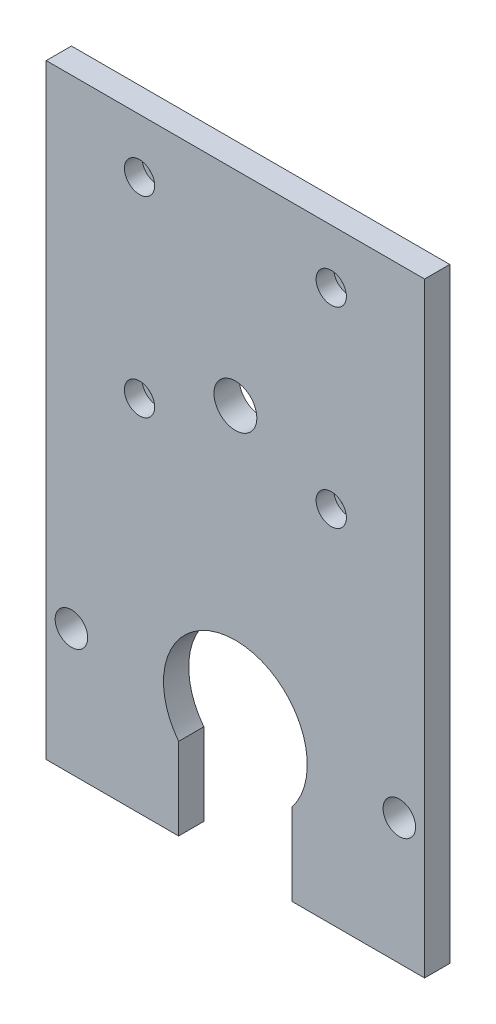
ISO-10303-21;
HEADER;
FILE_DESCRIPTION(('STEP AP214'),'2;1');
FILE_NAME('part.step','',(''),(''),'','','');
FILE_SCHEMA(('AUTOMOTIVE_DESIGN { 1 0 10303 214 1 1 1 1 }'));
ENDSEC;
DATA;
#1=APPLICATION_CONTEXT('core data for automotive mechanical design processes');
#2=APPLICATION_PROTOCOL_DEFINITION('international standard','automotive_design',2000,#1);
#3=PRODUCT_CONTEXT('',#1,'mechanical');
#4=PRODUCT('Part','Part','',(#3));
#5=PRODUCT_RELATED_PRODUCT_CATEGORY('part','',(#4));
#6=PRODUCT_DEFINITION_FORMATION('','',#4);
#7=PRODUCT_DEFINITION_CONTEXT('part definition',#1,'design');
#8=PRODUCT_DEFINITION('design','',#6,#7);
#9=PRODUCT_DEFINITION_SHAPE('','',#8);
#10=(LENGTH_UNIT() NAMED_UNIT(*) SI_UNIT(.MILLI.,.METRE.));
#11=(NAMED_UNIT(*) PLANE_ANGLE_UNIT() SI_UNIT($,.RADIAN.));
#12=(NAMED_UNIT(*) SI_UNIT($,.STERADIAN.) SOLID_ANGLE_UNIT());
#13=UNCERTAINTY_MEASURE_WITH_UNIT(LENGTH_MEASURE(1.E-05),#10,'distance_accuracy_value','');
#14=(GEOMETRIC_REPRESENTATION_CONTEXT(3) GLOBAL_UNCERTAINTY_ASSIGNED_CONTEXT((#13)) GLOBAL_UNIT_ASSIGNED_CONTEXT((#10,
#11,#12)) REPRESENTATION_CONTEXT('',''));
#15=CARTESIAN_POINT('',(0.,0.,0.));
#16=DIRECTION('',(0.,0.,1.));
#17=DIRECTION('',(1.,0.,0.));
#18=AXIS2_PLACEMENT_3D('',#15,#16,#17);
#19=CARTESIAN_POINT('',(0.,0.,5.));
#20=DIRECTION('',(0.,0.,1.));
#21=DIRECTION('',(1.,0.,0.));
#22=AXIS2_PLACEMENT_3D('',#19,#20,#21);
#23=PLANE('',#22);
#24=CARTESIAN_POINT('',(-38.,168.5,5.));
#25=DIRECTION('',(0.,0.,-1.));
#26=DIRECTION('',(-1.,0.,0.));
#27=AXIS2_PLACEMENT_3D('',#24,#25,#26);
#28=CIRCLE('',#27,6.);
#29=CARTESIAN_POINT('',(-44.,168.5,5.));
#30=VERTEX_POINT('',#29);
#31=EDGE_CURVE('E182',#30,#30,#28,.T.);
#32=ORIENTED_EDGE('',*,*,#31,.T.);
#33=EDGE_LOOP('',(#32));
#34=FACE_BOUND('',#33,.T.);
#35=CARTESIAN_POINT('',(38.,168.5,5.));
#36=DIRECTION('',(0.,0.,1.));
#37=DIRECTION('',(1.,0.,0.));
#38=AXIS2_PLACEMENT_3D('',#35,#36,#37);
#39=CIRCLE('',#38,6.);
#40=CARTESIAN_POINT('',(44.,168.5,5.));
#41=VERTEX_POINT('',#40);
#42=EDGE_CURVE('E178',#41,#41,#39,.T.);
#43=ORIENTED_EDGE('',*,*,#42,.F.);
#44=EDGE_LOOP('',(#43));
#45=FACE_BOUND('',#44,.T.);
#46=CARTESIAN_POINT('',(65.,0.,5.));
#47=DIRECTION('',(0.,0.,1.));
#48=DIRECTION('',(1.,0.,0.));
#49=AXIS2_PLACEMENT_3D('',#46,#47,#48);
#50=CIRCLE('',#49,6.45);
#51=CARTESIAN_POINT('',(71.45,0.,5.));
#52=VERTEX_POINT('',#51);
#53=EDGE_CURVE('E223',#52,#52,#50,.T.);
#54=ORIENTED_EDGE('',*,*,#53,.F.);
#55=EDGE_LOOP('',(#54));
#56=FACE_BOUND('',#55,.T.);
#57=DIRECTION('',(0.,-1.,0.));
#58=VECTOR('',#57,1.);
#59=CARTESIAN_POINT('',(-75.,-50.,5.));
#60=LINE('',#59,#58);
#61=CARTESIAN_POINT('',(-75.,190.,5.));
#62=VERTEX_POINT('',#61);
#63=CARTESIAN_POINT('',(-75.,-50.,5.));
#64=VERTEX_POINT('',#63);
#65=EDGE_CURVE('E141',#62,#64,#60,.T.);
#66=ORIENTED_EDGE('',*,*,#65,.T.);
#67=DIRECTION('',(1.,0.,0.));
#68=VECTOR('',#67,1.);
#69=CARTESIAN_POINT('',(-22.5,-50.,5.));
#70=LINE('',#69,#68);
#71=CARTESIAN_POINT('',(-22.5,-50.,5.));
#72=VERTEX_POINT('',#71);
#73=EDGE_CURVE('E118',#64,#72,#70,.T.);
#74=ORIENTED_EDGE('',*,*,#73,.T.);
#75=DIRECTION('',(0.,1.,0.));
#76=VECTOR('',#75,1.);
#77=CARTESIAN_POINT('',(-22.5,-17.4928556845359,5.));
#78=LINE('',#77,#76);
#79=CARTESIAN_POINT('',(-22.5,-17.4928556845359,5.));
#80=VERTEX_POINT('',#79);
#81=EDGE_CURVE('E144',#72,#80,#78,.T.);
#82=ORIENTED_EDGE('',*,*,#81,.T.);
#83=CARTESIAN_POINT('',(0.,0.,5.));
#84=DIRECTION('',(0.,0.,-1.));
#85=DIRECTION('',(1.,0.,0.));
#86=AXIS2_PLACEMENT_3D('',#83,#84,#85);
#87=CIRCLE('',#86,28.5);
#88=CARTESIAN_POINT('',(22.5,-17.4928556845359,5.));
#89=VERTEX_POINT('',#88);
#90=EDGE_CURVE('E146',#80,#89,#87,.T.);
#91=ORIENTED_EDGE('',*,*,#90,.T.);
#92=DIRECTION('',(0.,-1.,0.));
#93=VECTOR('',#92,1.);
#94=CARTESIAN_POINT('',(22.5,-17.4928556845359,5.));
#95=LINE('',#94,#93);
#96=CARTESIAN_POINT('',(22.5,-50.,5.));
#97=VERTEX_POINT('',#96);
#98=EDGE_CURVE('E148',#89,#97,#95,.T.);
#99=ORIENTED_EDGE('',*,*,#98,.T.);
#100=DIRECTION('',(1.,0.,0.));
#101=VECTOR('',#100,1.);
#102=CARTESIAN_POINT('',(22.5,-50.,5.));
#103=LINE('',#102,#101);
#104=CARTESIAN_POINT('',(75.,-50.,5.));
#105=VERTEX_POINT('',#104);
#106=EDGE_CURVE('E150',#97,#105,#103,.T.);
#107=ORIENTED_EDGE('',*,*,#106,.T.);
#108=DIRECTION('',(0.,1.,0.));
#109=VECTOR('',#108,1.);
#110=CARTESIAN_POINT('',(75.,-50.,5.));
#111=LINE('',#110,#109);
#112=CARTESIAN_POINT('',(75.,190.,5.));
#113=VERTEX_POINT('',#112);
#114=EDGE_CURVE('E59',#105,#113,#111,.T.);
#115=ORIENTED_EDGE('',*,*,#114,.T.);
#116=DIRECTION('',(-1.,0.,0.));
#117=VECTOR('',#116,1.);
#118=CARTESIAN_POINT('',(-75.,190.,5.));
#119=LINE('',#118,#117);
#120=EDGE_CURVE('E54',#113,#62,#119,.T.);
#121=ORIENTED_EDGE('',*,*,#120,.T.);
#122=EDGE_LOOP('',(#66,#74,#82,#91,#99,#107,#115,#121));
#123=FACE_BOUND('',#122,.T.);
#124=CARTESIAN_POINT('',(0.,109.,5.));
#125=DIRECTION('',(0.,0.,1.));
#126=DIRECTION('',(1.,0.,0.));
#127=AXIS2_PLACEMENT_3D('',#124,#125,#126);
#128=CIRCLE('',#127,8.50000000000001);
#129=CARTESIAN_POINT('',(8.50000000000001,109.,5.));
#130=VERTEX_POINT('',#129);
#131=EDGE_CURVE('E123',#130,#130,#128,.T.);
#132=ORIENTED_EDGE('',*,*,#131,.F.);
#133=EDGE_LOOP('',(#132));
#134=FACE_BOUND('',#133,.T.);
#135=CARTESIAN_POINT('',(-65.,0.,5.));
#136=DIRECTION('',(0.,0.,1.));
#137=DIRECTION('',(1.,0.,0.));
#138=AXIS2_PLACEMENT_3D('',#135,#136,#137);
#139=CIRCLE('',#138,6.45);
#140=CARTESIAN_POINT('',(-58.55,0.,5.));
#141=VERTEX_POINT('',#140);
#142=EDGE_CURVE('E217',#141,#141,#139,.T.);
#143=ORIENTED_EDGE('',*,*,#142,.F.);
#144=EDGE_LOOP('',(#143));
#145=FACE_BOUND('',#144,.T.);
#146=CARTESIAN_POINT('',(-38.,92.5000000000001,5.));
#147=DIRECTION('',(0.,0.,1.));
#148=DIRECTION('',(-1.,0.,0.));
#149=AXIS2_PLACEMENT_3D('',#146,#147,#148);
#150=CIRCLE('',#149,6.);
#151=CARTESIAN_POINT('',(-44.,92.5000000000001,5.));
#152=VERTEX_POINT('',#151);
#153=EDGE_CURVE('E189',#152,#152,#150,.T.);
#154=ORIENTED_EDGE('',*,*,#153,.F.);
#155=EDGE_LOOP('',(#154));
#156=FACE_BOUND('',#155,.T.);
#157=CARTESIAN_POINT('',(38.,92.5000000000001,5.));
#158=DIRECTION('',(0.,0.,-1.));
#159=DIRECTION('',(1.,0.,0.));
#160=AXIS2_PLACEMENT_3D('',#157,#158,#159);
#161=CIRCLE('',#160,6.);
#162=CARTESIAN_POINT('',(44.,92.5000000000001,5.));
#163=VERTEX_POINT('',#162);
#164=EDGE_CURVE('E346',#163,#163,#161,.T.);
#165=ORIENTED_EDGE('',*,*,#164,.T.);
#166=EDGE_LOOP('',(#165));
#167=FACE_BOUND('',#166,.T.);
#168=ADVANCED_FACE('F37',(#34,#45,#56,#123,#134,#145,#156,#167),#23,.T.);
#169=CARTESIAN_POINT('',(38.,92.5000000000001,-5.));
#170=DIRECTION('',(0.,0.,1.));
#171=DIRECTION('',(1.,0.,0.));
#172=AXIS2_PLACEMENT_3D('',#169,#170,#171);
#173=CYLINDRICAL_SURFACE('',#172,4.00000000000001);
#174=CARTESIAN_POINT('',(38.,92.5000000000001,-5.));
#175=DIRECTION('',(0.,0.,1.));
#176=DIRECTION('',(-1.,0.,0.));
#177=AXIS2_PLACEMENT_3D('',#174,#175,#176);
#178=CIRCLE('',#177,4.00000000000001);
#179=CARTESIAN_POINT('',(34.,92.5000000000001,-5.));
#180=VERTEX_POINT('',#179);
#181=EDGE_CURVE('E205',#180,#180,#178,.T.);
#182=ORIENTED_EDGE('',*,*,#181,.F.);
#183=EDGE_LOOP('',(#182));
#184=FACE_BOUND('',#183,.T.);
#185=CARTESIAN_POINT('',(38.,92.5000000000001,-2.));
#186=DIRECTION('',(0.,0.,1.));
#187=DIRECTION('',(1.,0.,0.));
#188=AXIS2_PLACEMENT_3D('',#185,#186,#187);
#189=CIRCLE('',#188,4.00000000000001);
#190=CARTESIAN_POINT('',(42.,92.5000000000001,-2.));
#191=VERTEX_POINT('',#190);
#192=EDGE_CURVE('E41',#191,#191,#189,.F.);
#193=ORIENTED_EDGE('',*,*,#192,.F.);
#194=EDGE_LOOP('',(#193));
#195=FACE_BOUND('',#194,.T.);
#196=ADVANCED_FACE('F247',(#184,#195),#173,.F.);
#197=CARTESIAN_POINT('',(-38.,92.5000000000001,-5.));
#198=DIRECTION('',(0.,0.,1.));
#199=DIRECTION('',(1.,0.,0.));
#200=AXIS2_PLACEMENT_3D('',#197,#198,#199);
#201=CYLINDRICAL_SURFACE('',#200,4.00000000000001);
#202=CARTESIAN_POINT('',(-38.,92.5000000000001,-5.));
#203=DIRECTION('',(0.,0.,-1.));
#204=DIRECTION('',(1.,0.,0.));
#205=AXIS2_PLACEMENT_3D('',#202,#203,#204);
#206=CIRCLE('',#205,4.00000000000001);
#207=CARTESIAN_POINT('',(-34.,92.5000000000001,-5.));
#208=VERTEX_POINT('',#207);
#209=EDGE_CURVE('E174',#208,#208,#206,.T.);
#210=ORIENTED_EDGE('',*,*,#209,.T.);
#211=EDGE_LOOP('',(#210));
#212=FACE_BOUND('',#211,.T.);
#213=CARTESIAN_POINT('',(-38.,92.5000000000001,-2.));
#214=DIRECTION('',(0.,0.,1.));
#215=DIRECTION('',(1.,0.,0.));
#216=AXIS2_PLACEMENT_3D('',#213,#214,#215);
#217=CIRCLE('',#216,4.00000000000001);
#218=CARTESIAN_POINT('',(-34.,92.5000000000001,-2.));
#219=VERTEX_POINT('',#218);
#220=EDGE_CURVE('E180',#219,#219,#217,.T.);
#221=ORIENTED_EDGE('',*,*,#220,.T.);
#222=EDGE_LOOP('',(#221));
#223=FACE_BOUND('',#222,.T.);
#224=ADVANCED_FACE('F253',(#212,#223),#201,.F.);
#225=CARTESIAN_POINT('',(-38.,168.5,-5.));
#226=DIRECTION('',(0.,0.,1.));
#227=DIRECTION('',(1.,0.,0.));
#228=AXIS2_PLACEMENT_3D('',#225,#226,#227);
#229=CYLINDRICAL_SURFACE('',#228,4.00000000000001);
#230=CARTESIAN_POINT('',(-38.,168.5,-5.));
#231=DIRECTION('',(0.,0.,1.));
#232=DIRECTION('',(1.,0.,0.));
#233=AXIS2_PLACEMENT_3D('',#230,#231,#232);
#234=CIRCLE('',#233,4.00000000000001);
#235=CARTESIAN_POINT('',(-34.,168.5,-5.));
#236=VERTEX_POINT('',#235);
#237=EDGE_CURVE('E211',#236,#236,#234,.T.);
#238=ORIENTED_EDGE('',*,*,#237,.F.);
#239=EDGE_LOOP('',(#238));
#240=FACE_BOUND('',#239,.T.);
#241=CARTESIAN_POINT('',(-38.,168.5,-2.));
#242=DIRECTION('',(0.,0.,1.));
#243=DIRECTION('',(1.,0.,0.));
#244=AXIS2_PLACEMENT_3D('',#241,#242,#243);
#245=CIRCLE('',#244,4.00000000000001);
#246=CARTESIAN_POINT('',(-34.,168.5,-2.));
#247=VERTEX_POINT('',#246);
#248=EDGE_CURVE('E176',#247,#247,#245,.F.);
#249=ORIENTED_EDGE('',*,*,#248,.F.);
#250=EDGE_LOOP('',(#249));
#251=FACE_BOUND('',#250,.T.);
#252=ADVANCED_FACE('F288',(#240,#251),#229,.F.);
#253=CARTESIAN_POINT('',(38.,168.5,-5.));
#254=DIRECTION('',(0.,0.,1.));
#255=DIRECTION('',(1.,0.,0.));
#256=AXIS2_PLACEMENT_3D('',#253,#254,#255);
#257=CYLINDRICAL_SURFACE('',#256,4.00000000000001);
#258=CARTESIAN_POINT('',(38.,168.5,-5.));
#259=DIRECTION('',(0.,0.,-1.));
#260=DIRECTION('',(-1.,0.,0.));
#261=AXIS2_PLACEMENT_3D('',#258,#259,#260);
#262=CIRCLE('',#261,4.00000000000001);
#263=CARTESIAN_POINT('',(34.,168.5,-5.));
#264=VERTEX_POINT('',#263);
#265=EDGE_CURVE('E208',#264,#264,#262,.T.);
#266=ORIENTED_EDGE('',*,*,#265,.T.);
#267=EDGE_LOOP('',(#266));
#268=FACE_BOUND('',#267,.T.);
#269=CARTESIAN_POINT('',(38.,168.5,-2.));
#270=DIRECTION('',(0.,0.,1.));
#271=DIRECTION('',(1.,0.,0.));
#272=AXIS2_PLACEMENT_3D('',#269,#270,#271);
#273=CIRCLE('',#272,4.00000000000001);
#274=CARTESIAN_POINT('',(42.,168.5,-2.));
#275=VERTEX_POINT('',#274);
#276=EDGE_CURVE('E171',#275,#275,#273,.T.);
#277=ORIENTED_EDGE('',*,*,#276,.T.);
#278=EDGE_LOOP('',(#277));
#279=FACE_BOUND('',#278,.T.);
#280=ADVANCED_FACE('F283',(#268,#279),#257,.F.);
#281=CARTESIAN_POINT('',(0.,0.,-5.));
#282=DIRECTION('',(0.,0.,1.));
#283=DIRECTION('',(1.,0.,0.));
#284=AXIS2_PLACEMENT_3D('',#281,#282,#283);
#285=PLANE('',#284);
#286=ORIENTED_EDGE('',*,*,#265,.F.);
#287=EDGE_LOOP('',(#286));
#288=FACE_BOUND('',#287,.T.);
#289=ORIENTED_EDGE('',*,*,#237,.T.);
#290=EDGE_LOOP('',(#289));
#291=FACE_BOUND('',#290,.T.);
#292=CARTESIAN_POINT('',(65.,0.,-5.));
#293=DIRECTION('',(0.,0.,1.));
#294=DIRECTION('',(1.,0.,0.));
#295=AXIS2_PLACEMENT_3D('',#292,#293,#294);
#296=CIRCLE('',#295,6.45);
#297=CARTESIAN_POINT('',(71.45,0.,-5.));
#298=VERTEX_POINT('',#297);
#299=EDGE_CURVE('E220',#298,#298,#296,.T.);
#300=ORIENTED_EDGE('',*,*,#299,.T.);
#301=EDGE_LOOP('',(#300));
#302=FACE_BOUND('',#301,.T.);
#303=DIRECTION('',(0.,-1.,0.));
#304=VECTOR('',#303,1.);
#305=CARTESIAN_POINT('',(-75.,-50.,-5.));
#306=LINE('',#305,#304);
#307=CARTESIAN_POINT('',(-75.,190.,-5.));
#308=VERTEX_POINT('',#307);
#309=CARTESIAN_POINT('',(-75.,-50.,-5.));
#310=VERTEX_POINT('',#309);
#311=EDGE_CURVE('E109',#308,#310,#306,.T.);
#312=ORIENTED_EDGE('',*,*,#311,.F.);
#313=DIRECTION('',(-1.,0.,0.));
#314=VECTOR('',#313,1.);
#315=CARTESIAN_POINT('',(-75.,190.,-5.));
#316=LINE('',#315,#314);
#317=CARTESIAN_POINT('',(75.,190.,-5.));
#318=VERTEX_POINT('',#317);
#319=EDGE_CURVE('E139',#318,#308,#316,.T.);
#320=ORIENTED_EDGE('',*,*,#319,.F.);
#321=DIRECTION('',(0.,1.,0.));
#322=VECTOR('',#321,1.);
#323=CARTESIAN_POINT('',(75.,-50.,-5.));
#324=LINE('',#323,#322);
#325=CARTESIAN_POINT('',(75.,-50.,-5.));
#326=VERTEX_POINT('',#325);
#327=EDGE_CURVE('E137',#326,#318,#324,.T.);
#328=ORIENTED_EDGE('',*,*,#327,.F.);
#329=DIRECTION('',(1.,0.,0.));
#330=VECTOR('',#329,1.);
#331=CARTESIAN_POINT('',(22.5,-50.,-5.));
#332=LINE('',#331,#330);
#333=CARTESIAN_POINT('',(22.5,-50.,-5.));
#334=VERTEX_POINT('',#333);
#335=EDGE_CURVE('E135',#334,#326,#332,.T.);
#336=ORIENTED_EDGE('',*,*,#335,.F.);
#337=DIRECTION('',(0.,-1.,0.));
#338=VECTOR('',#337,1.);
#339=CARTESIAN_POINT('',(22.5,-17.4928556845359,-5.));
#340=LINE('',#339,#338);
#341=CARTESIAN_POINT('',(22.5,-17.4928556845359,-5.));
#342=VERTEX_POINT('',#341);
#343=EDGE_CURVE('E133',#342,#334,#340,.T.);
#344=ORIENTED_EDGE('',*,*,#343,.F.);
#345=CARTESIAN_POINT('',(0.,0.,-5.));
#346=DIRECTION('',(0.,0.,-1.));
#347=DIRECTION('',(1.,0.,0.));
#348=AXIS2_PLACEMENT_3D('',#345,#346,#347);
#349=CIRCLE('',#348,28.5);
#350=CARTESIAN_POINT('',(-22.5,-17.4928556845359,-5.));
#351=VERTEX_POINT('',#350);
#352=EDGE_CURVE('E131',#351,#342,#349,.T.);
#353=ORIENTED_EDGE('',*,*,#352,.F.);
#354=DIRECTION('',(0.,1.,0.));
#355=VECTOR('',#354,1.);
#356=CARTESIAN_POINT('',(-22.5,-17.4928556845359,-5.));
#357=LINE('',#356,#355);
#358=CARTESIAN_POINT('',(-22.5,-50.,-5.));
#359=VERTEX_POINT('',#358);
#360=EDGE_CURVE('E111',#359,#351,#357,.T.);
#361=ORIENTED_EDGE('',*,*,#360,.F.);
#362=DIRECTION('',(1.,0.,0.));
#363=VECTOR('',#362,1.);
#364=CARTESIAN_POINT('',(-22.5,-50.,-5.));
#365=LINE('',#364,#363);
#366=EDGE_CURVE('E104',#310,#359,#365,.T.);
#367=ORIENTED_EDGE('',*,*,#366,.F.);
#368=EDGE_LOOP('',(#312,#320,#328,#336,#344,#353,#361,#367));
#369=FACE_BOUND('',#368,.T.);
#370=CARTESIAN_POINT('',(0.,109.,-5.));
#371=DIRECTION('',(0.,0.,1.));
#372=DIRECTION('',(1.,0.,0.));
#373=AXIS2_PLACEMENT_3D('',#370,#371,#372);
#374=CIRCLE('',#373,8.50000000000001);
#375=CARTESIAN_POINT('',(8.50000000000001,109.,-5.));
#376=VERTEX_POINT('',#375);
#377=EDGE_CURVE('E126',#376,#376,#374,.T.);
#378=ORIENTED_EDGE('',*,*,#377,.T.);
#379=EDGE_LOOP('',(#378));
#380=FACE_BOUND('',#379,.T.);
#381=CARTESIAN_POINT('',(-65.,0.,-5.));
#382=DIRECTION('',(0.,0.,1.));
#383=DIRECTION('',(1.,0.,0.));
#384=AXIS2_PLACEMENT_3D('',#381,#382,#383);
#385=CIRCLE('',#384,6.45);
#386=CARTESIAN_POINT('',(-58.55,0.,-5.));
#387=VERTEX_POINT('',#386);
#388=EDGE_CURVE('E214',#387,#387,#385,.T.);
#389=ORIENTED_EDGE('',*,*,#388,.T.);
#390=EDGE_LOOP('',(#389));
#391=FACE_BOUND('',#390,.T.);
#392=ORIENTED_EDGE('',*,*,#181,.T.);
#393=EDGE_LOOP('',(#392));
#394=FACE_BOUND('',#393,.T.);
#395=ORIENTED_EDGE('',*,*,#209,.F.);
#396=EDGE_LOOP('',(#395));
#397=FACE_BOUND('',#396,.T.);
#398=ADVANCED_FACE('F105',(#288,#291,#302,#369,#380,#391,#394,#397),#285,.F.);
#399=CARTESIAN_POINT('',(-75.,-50.,5.));
#400=DIRECTION('',(1.,0.,0.));
#401=DIRECTION('',(0.,1.,0.));
#402=AXIS2_PLACEMENT_3D('',#399,#400,#401);
#403=PLANE('',#402);
#404=ORIENTED_EDGE('',*,*,#311,.T.);
#405=DIRECTION('',(0.,0.,-1.));
#406=VECTOR('',#405,1.);
#407=CARTESIAN_POINT('',(-75.,-50.,5.));
#408=LINE('',#407,#406);
#409=EDGE_CURVE('E11',#64,#310,#408,.T.);
#410=ORIENTED_EDGE('',*,*,#409,.F.);
#411=ORIENTED_EDGE('',*,*,#65,.F.);
#412=DIRECTION('',(0.,0.,-1.));
#413=VECTOR('',#412,1.);
#414=CARTESIAN_POINT('',(-75.,190.,5.));
#415=LINE('',#414,#413);
#416=EDGE_CURVE('E122',#62,#308,#415,.T.);
#417=ORIENTED_EDGE('',*,*,#416,.T.);
#418=EDGE_LOOP('',(#404,#410,#411,#417));
#419=FACE_BOUND('',#418,.T.);
#420=ADVANCED_FACE('F39',(#419),#403,.F.);
#421=CARTESIAN_POINT('',(-22.5,-50.,5.));
#422=DIRECTION('',(0.,1.,0.));
#423=DIRECTION('',(-1.,0.,0.));
#424=AXIS2_PLACEMENT_3D('',#421,#422,#423);
#425=PLANE('',#424);
#426=ORIENTED_EDGE('',*,*,#366,.T.);
#427=DIRECTION('',(0.,0.,-1.));
#428=VECTOR('',#427,1.);
#429=CARTESIAN_POINT('',(-22.5,-50.,5.));
#430=LINE('',#429,#428);
#431=EDGE_CURVE('E46',#72,#359,#430,.T.);
#432=ORIENTED_EDGE('',*,*,#431,.F.);
#433=ORIENTED_EDGE('',*,*,#73,.F.);
#434=ORIENTED_EDGE('',*,*,#409,.T.);
#435=EDGE_LOOP('',(#426,#432,#433,#434));
#436=FACE_BOUND('',#435,.T.);
#437=ADVANCED_FACE('F117',(#436),#425,.F.);
#438=CARTESIAN_POINT('',(-22.5,-17.4928556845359,5.));
#439=DIRECTION('',(-1.,0.,0.));
#440=DIRECTION('',(0.,-1.,0.));
#441=AXIS2_PLACEMENT_3D('',#438,#439,#440);
#442=PLANE('',#441);
#443=ORIENTED_EDGE('',*,*,#360,.T.);
#444=DIRECTION('',(0.,0.,-1.));
#445=VECTOR('',#444,1.);
#446=CARTESIAN_POINT('',(-22.5,-17.4928556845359,5.));
#447=LINE('',#446,#445);
#448=EDGE_CURVE('E167',#80,#351,#447,.T.);
#449=ORIENTED_EDGE('',*,*,#448,.F.);
#450=ORIENTED_EDGE('',*,*,#81,.F.);
#451=ORIENTED_EDGE('',*,*,#431,.T.);
#452=EDGE_LOOP('',(#443,#449,#450,#451));
#453=FACE_BOUND('',#452,.T.);
#454=ADVANCED_FACE('F272',(#453),#442,.F.);
#455=CARTESIAN_POINT('',(0.,0.,5.));
#456=DIRECTION('',(0.,0.,-1.));
#457=DIRECTION('',(-1.,0.,0.));
#458=AXIS2_PLACEMENT_3D('',#455,#456,#457);
#459=CYLINDRICAL_SURFACE('',#458,28.5);
#460=ORIENTED_EDGE('',*,*,#352,.T.);
#461=DIRECTION('',(0.,0.,-1.));
#462=VECTOR('',#461,1.);
#463=CARTESIAN_POINT('',(22.5,-17.4928556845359,5.));
#464=LINE('',#463,#462);
#465=EDGE_CURVE('E164',#89,#342,#464,.T.);
#466=ORIENTED_EDGE('',*,*,#465,.F.);
#467=ORIENTED_EDGE('',*,*,#90,.F.);
#468=ORIENTED_EDGE('',*,*,#448,.T.);
#469=EDGE_LOOP('',(#460,#466,#467,#468));
#470=FACE_BOUND('',#469,.T.);
#471=ADVANCED_FACE('F268',(#470),#459,.F.);
#472=CARTESIAN_POINT('',(22.5,-17.4928556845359,5.));
#473=DIRECTION('',(1.,0.,0.));
#474=DIRECTION('',(0.,1.,0.));
#475=AXIS2_PLACEMENT_3D('',#472,#473,#474);
#476=PLANE('',#475);
#477=ORIENTED_EDGE('',*,*,#343,.T.);
#478=DIRECTION('',(0.,0.,-1.));
#479=VECTOR('',#478,1.);
#480=CARTESIAN_POINT('',(22.5,-50.,5.));
#481=LINE('',#480,#479);
#482=EDGE_CURVE('E161',#97,#334,#481,.T.);
#483=ORIENTED_EDGE('',*,*,#482,.F.);
#484=ORIENTED_EDGE('',*,*,#98,.F.);
#485=ORIENTED_EDGE('',*,*,#465,.T.);
#486=EDGE_LOOP('',(#477,#483,#484,#485));
#487=FACE_BOUND('',#486,.T.);
#488=ADVANCED_FACE('F264',(#487),#476,.F.);
#489=CARTESIAN_POINT('',(22.5,-50.,5.));
#490=DIRECTION('',(0.,1.,0.));
#491=DIRECTION('',(-1.,0.,0.));
#492=AXIS2_PLACEMENT_3D('',#489,#490,#491);
#493=PLANE('',#492);
#494=ORIENTED_EDGE('',*,*,#335,.T.);
#495=DIRECTION('',(0.,0.,-1.));
#496=VECTOR('',#495,1.);
#497=CARTESIAN_POINT('',(75.,-50.,5.));
#498=LINE('',#497,#496);
#499=EDGE_CURVE('E158',#105,#326,#498,.T.);
#500=ORIENTED_EDGE('',*,*,#499,.F.);
#501=ORIENTED_EDGE('',*,*,#106,.F.);
#502=ORIENTED_EDGE('',*,*,#482,.T.);
#503=EDGE_LOOP('',(#494,#500,#501,#502));
#504=FACE_BOUND('',#503,.T.);
#505=ADVANCED_FACE('F260',(#504),#493,.F.);
#506=CARTESIAN_POINT('',(75.,-50.,5.));
#507=DIRECTION('',(-1.,0.,0.));
#508=DIRECTION('',(0.,-1.,0.));
#509=AXIS2_PLACEMENT_3D('',#506,#507,#508);
#510=PLANE('',#509);
#511=ORIENTED_EDGE('',*,*,#327,.T.);
#512=DIRECTION('',(0.,0.,-1.));
#513=VECTOR('',#512,1.);
#514=CARTESIAN_POINT('',(75.,190.,5.));
#515=LINE('',#514,#513);
#516=EDGE_CURVE('E155',#113,#318,#515,.T.);
#517=ORIENTED_EDGE('',*,*,#516,.F.);
#518=ORIENTED_EDGE('',*,*,#114,.F.);
#519=ORIENTED_EDGE('',*,*,#499,.T.);
#520=EDGE_LOOP('',(#511,#517,#518,#519));
#521=FACE_BOUND('',#520,.T.);
#522=ADVANCED_FACE('F242',(#521),#510,.F.);
#523=CARTESIAN_POINT('',(-75.,190.,5.));
#524=DIRECTION('',(0.,-1.,0.));
#525=DIRECTION('',(0.,0.,-1.));
#526=AXIS2_PLACEMENT_3D('',#523,#524,#525);
#527=PLANE('',#526);
#528=ORIENTED_EDGE('',*,*,#319,.T.);
#529=ORIENTED_EDGE('',*,*,#416,.F.);
#530=ORIENTED_EDGE('',*,*,#120,.F.);
#531=ORIENTED_EDGE('',*,*,#516,.T.);
#532=EDGE_LOOP('',(#528,#529,#530,#531));
#533=FACE_BOUND('',#532,.T.);
#534=ADVANCED_FACE('F232',(#533),#527,.F.);
#535=CARTESIAN_POINT('',(0.,109.,5.));
#536=DIRECTION('',(0.,0.,-1.));
#537=DIRECTION('',(-1.,0.,0.));
#538=AXIS2_PLACEMENT_3D('',#535,#536,#537);
#539=CYLINDRICAL_SURFACE('',#538,8.50000000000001);
#540=ORIENTED_EDGE('',*,*,#131,.T.);
#541=EDGE_LOOP('',(#540));
#542=FACE_BOUND('',#541,.T.);
#543=ORIENTED_EDGE('',*,*,#377,.F.);
#544=EDGE_LOOP('',(#543));
#545=FACE_BOUND('',#544,.T.);
#546=ADVANCED_FACE('F229',(#542,#545),#539,.F.);
#547=CARTESIAN_POINT('',(65.,0.,5.));
#548=DIRECTION('',(0.,0.,-1.));
#549=DIRECTION('',(-1.,0.,0.));
#550=AXIS2_PLACEMENT_3D('',#547,#548,#549);
#551=CYLINDRICAL_SURFACE('',#550,6.45);
#552=ORIENTED_EDGE('',*,*,#53,.T.);
#553=EDGE_LOOP('',(#552));
#554=FACE_BOUND('',#553,.T.);
#555=ORIENTED_EDGE('',*,*,#299,.F.);
#556=EDGE_LOOP('',(#555));
#557=FACE_BOUND('',#556,.T.);
#558=ADVANCED_FACE('F231',(#554,#557),#551,.F.);
#559=CARTESIAN_POINT('',(-65.,0.,5.));
#560=DIRECTION('',(0.,0.,-1.));
#561=DIRECTION('',(-1.,0.,0.));
#562=AXIS2_PLACEMENT_3D('',#559,#560,#561);
#563=CYLINDRICAL_SURFACE('',#562,6.45);
#564=ORIENTED_EDGE('',*,*,#142,.T.);
#565=EDGE_LOOP('',(#564));
#566=FACE_BOUND('',#565,.T.);
#567=ORIENTED_EDGE('',*,*,#388,.F.);
#568=EDGE_LOOP('',(#567));
#569=FACE_BOUND('',#568,.T.);
#570=ADVANCED_FACE('F239',(#566,#569),#563,.F.);
#571=CARTESIAN_POINT('',(38.,168.5,-2.));
#572=DIRECTION('',(0.,0.,1.));
#573=DIRECTION('',(1.,0.,0.));
#574=AXIS2_PLACEMENT_3D('',#571,#572,#573);
#575=CYLINDRICAL_SURFACE('',#574,6.);
#576=CARTESIAN_POINT('',(38.,168.5,-2.));
#577=DIRECTION('',(0.,0.,1.));
#578=DIRECTION('',(1.,0.,0.));
#579=AXIS2_PLACEMENT_3D('',#576,#577,#578);
#580=CIRCLE('',#579,6.);
#581=CARTESIAN_POINT('',(44.,168.5,-2.));
#582=VERTEX_POINT('',#581);
#583=EDGE_CURVE('E175',#582,#582,#580,.T.);
#584=ORIENTED_EDGE('',*,*,#583,.F.);
#585=EDGE_LOOP('',(#584));
#586=FACE_BOUND('',#585,.T.);
#587=ORIENTED_EDGE('',*,*,#42,.T.);
#588=EDGE_LOOP('',(#587));
#589=FACE_BOUND('',#588,.T.);
#590=ADVANCED_FACE('F316',(#586,#589),#575,.F.);
#591=CARTESIAN_POINT('',(38.,168.5,-2.));
#592=DIRECTION('',(0.,0.,1.));
#593=DIRECTION('',(1.,0.,0.));
#594=AXIS2_PLACEMENT_3D('',#591,#592,#593);
#595=PLANE('',#594);
#596=ORIENTED_EDGE('',*,*,#276,.F.);
#597=EDGE_LOOP('',(#596));
#598=FACE_BOUND('',#597,.T.);
#599=ORIENTED_EDGE('',*,*,#583,.T.);
#600=EDGE_LOOP('',(#599));
#601=FACE_BOUND('',#600,.T.);
#602=ADVANCED_FACE('F306',(#598,#601),#595,.T.);
#603=CARTESIAN_POINT('',(-38.,168.5,-2.));
#604=DIRECTION('',(0.,0.,1.));
#605=DIRECTION('',(-1.,0.,0.));
#606=AXIS2_PLACEMENT_3D('',#603,#604,#605);
#607=PLANE('',#606);
#608=CARTESIAN_POINT('',(-38.,168.5,-2.));
#609=DIRECTION('',(0.,0.,-1.));
#610=DIRECTION('',(-1.,0.,0.));
#611=AXIS2_PLACEMENT_3D('',#608,#609,#610);
#612=CIRCLE('',#611,6.);
#613=CARTESIAN_POINT('',(-44.,168.5,-2.));
#614=VERTEX_POINT('',#613);
#615=EDGE_CURVE('E179',#614,#614,#612,.T.);
#616=ORIENTED_EDGE('',*,*,#615,.F.);
#617=EDGE_LOOP('',(#616));
#618=FACE_BOUND('',#617,.T.);
#619=ORIENTED_EDGE('',*,*,#248,.T.);
#620=EDGE_LOOP('',(#619));
#621=FACE_BOUND('',#620,.T.);
#622=ADVANCED_FACE('F303',(#618,#621),#607,.T.);
#623=CARTESIAN_POINT('',(-38.,168.5,-2.));
#624=DIRECTION('',(0.,0.,1.));
#625=DIRECTION('',(1.,0.,0.));
#626=AXIS2_PLACEMENT_3D('',#623,#624,#625);
#627=CYLINDRICAL_SURFACE('',#626,6.);
#628=ORIENTED_EDGE('',*,*,#615,.T.);
#629=EDGE_LOOP('',(#628));
#630=FACE_BOUND('',#629,.T.);
#631=ORIENTED_EDGE('',*,*,#31,.F.);
#632=EDGE_LOOP('',(#631));
#633=FACE_BOUND('',#632,.T.);
#634=ADVANCED_FACE('F305',(#630,#633),#627,.F.);
#635=CARTESIAN_POINT('',(-38.,92.5000000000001,-2.));
#636=DIRECTION('',(0.,0.,1.));
#637=DIRECTION('',(1.,0.,0.));
#638=AXIS2_PLACEMENT_3D('',#635,#636,#637);
#639=CYLINDRICAL_SURFACE('',#638,6.);
#640=CARTESIAN_POINT('',(-38.,92.5000000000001,-2.));
#641=DIRECTION('',(0.,0.,1.));
#642=DIRECTION('',(-1.,0.,0.));
#643=AXIS2_PLACEMENT_3D('',#640,#641,#642);
#644=CIRCLE('',#643,6.);
#645=CARTESIAN_POINT('',(-44.,92.5000000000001,-2.));
#646=VERTEX_POINT('',#645);
#647=EDGE_CURVE('E183',#646,#646,#644,.T.);
#648=ORIENTED_EDGE('',*,*,#647,.F.);
#649=EDGE_LOOP('',(#648));
#650=FACE_BOUND('',#649,.T.);
#651=ORIENTED_EDGE('',*,*,#153,.T.);
#652=EDGE_LOOP('',(#651));
#653=FACE_BOUND('',#652,.T.);
#654=ADVANCED_FACE('F313',(#650,#653),#639,.F.);
#655=CARTESIAN_POINT('',(-38.,92.5000000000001,-2.));
#656=DIRECTION('',(0.,0.,1.));
#657=DIRECTION('',(-1.,0.,0.));
#658=AXIS2_PLACEMENT_3D('',#655,#656,#657);
#659=PLANE('',#658);
#660=ORIENTED_EDGE('',*,*,#220,.F.);
#661=EDGE_LOOP('',(#660));
#662=FACE_BOUND('',#661,.T.);
#663=ORIENTED_EDGE('',*,*,#647,.T.);
#664=EDGE_LOOP('',(#663));
#665=FACE_BOUND('',#664,.T.);
#666=ADVANCED_FACE('F361',(#662,#665),#659,.T.);
#667=CARTESIAN_POINT('',(38.,92.5000000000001,-2.));
#668=DIRECTION('',(0.,0.,1.));
#669=DIRECTION('',(1.,0.,0.));
#670=AXIS2_PLACEMENT_3D('',#667,#668,#669);
#671=PLANE('',#670);
#672=CARTESIAN_POINT('',(38.,92.5000000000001,-2.));
#673=DIRECTION('',(0.,0.,-1.));
#674=DIRECTION('',(1.,0.,0.));
#675=AXIS2_PLACEMENT_3D('',#672,#673,#674);
#676=CIRCLE('',#675,6.);
#677=CARTESIAN_POINT('',(44.,92.5000000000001,-2.));
#678=VERTEX_POINT('',#677);
#679=EDGE_CURVE('E344',#678,#678,#676,.T.);
#680=ORIENTED_EDGE('',*,*,#679,.F.);
#681=EDGE_LOOP('',(#680));
#682=FACE_BOUND('',#681,.T.);
#683=ORIENTED_EDGE('',*,*,#192,.T.);
#684=EDGE_LOOP('',(#683));
#685=FACE_BOUND('',#684,.T.);
#686=ADVANCED_FACE('F356',(#682,#685),#671,.T.);
#687=CARTESIAN_POINT('',(38.,92.5000000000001,-2.));
#688=DIRECTION('',(0.,0.,1.));
#689=DIRECTION('',(1.,0.,0.));
#690=AXIS2_PLACEMENT_3D('',#687,#688,#689);
#691=CYLINDRICAL_SURFACE('',#690,6.);
#692=ORIENTED_EDGE('',*,*,#679,.T.);
#693=EDGE_LOOP('',(#692));
#694=FACE_BOUND('',#693,.T.);
#695=ORIENTED_EDGE('',*,*,#164,.F.);
#696=EDGE_LOOP('',(#695));
#697=FACE_BOUND('',#696,.T.);
#698=ADVANCED_FACE('F354',(#694,#697),#691,.F.);
#699=CLOSED_SHELL('',(#168,#196,#224,#252,#280,#398,#420,#437,#454,#471,#488,#505,#522,#534,
#546,#558,#570,#590,#602,#622,#634,#654,#666,#686,#698));
#700=MANIFOLD_SOLID_BREP('B2',#699);
#701=ADVANCED_BREP_SHAPE_REPRESENTATION('',(#18,#700),#14);
#702=SHAPE_DEFINITION_REPRESENTATION(#9,#701);
ENDSEC;
END-ISO-10303-21;
